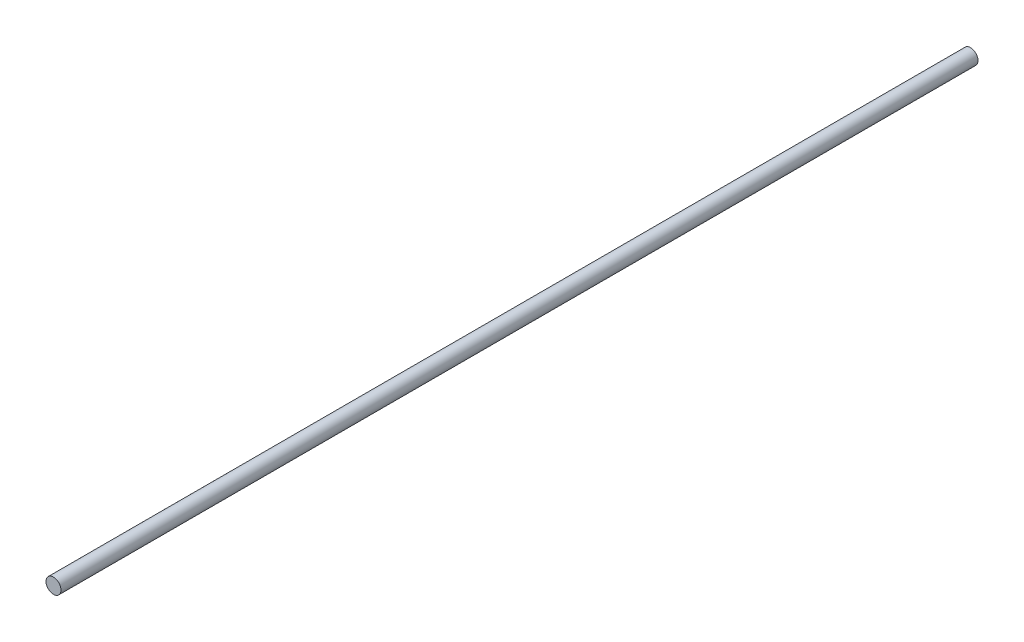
from build123d import *

# Parameters (mm, degrees)
ESQUISSE1_R          = 2
BASE_EXTRUSION_DEPTH = 122.5


with BuildPart() as part:
    # Esquisse1 → Base-Extrusion (new, symmetric)
    with BuildSketch(Plane.XY):
        Circle(ESQUISSE1_R)
    extrude(amount=BASE_EXTRUSION_DEPTH, both=True)


solid = part.part
